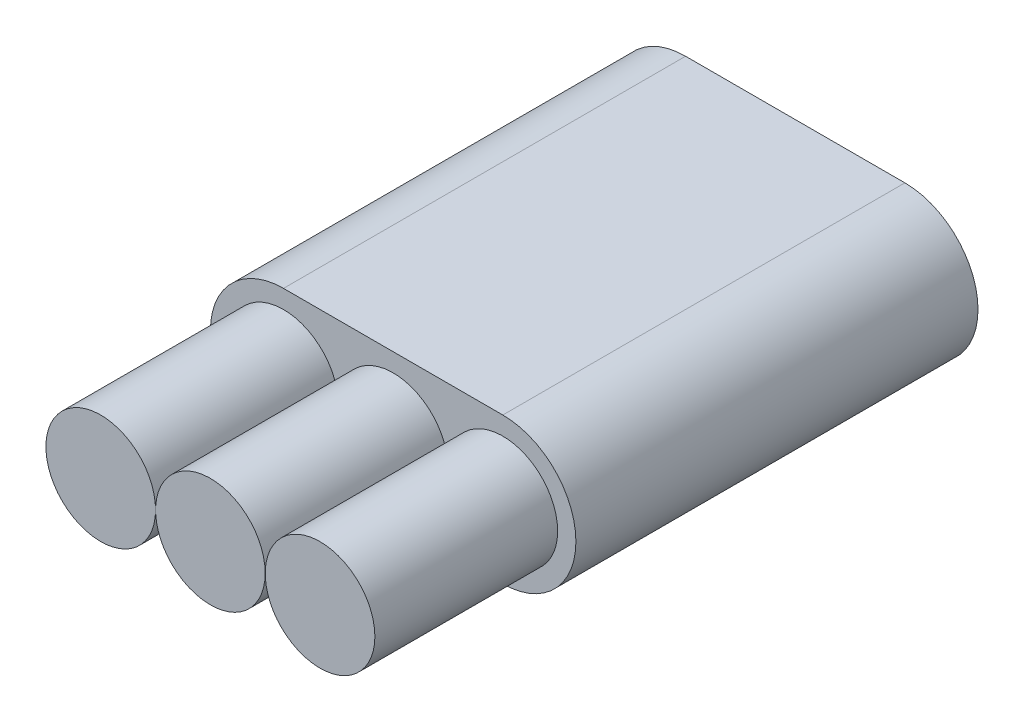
ISO-10303-21;
HEADER;
FILE_DESCRIPTION(('STEP AP214'),'2;1');
FILE_NAME('part.step','',(''),(''),'','','');
FILE_SCHEMA(('AUTOMOTIVE_DESIGN { 1 0 10303 214 1 1 1 1 }'));
ENDSEC;
DATA;
#1=APPLICATION_CONTEXT('core data for automotive mechanical design processes');
#2=APPLICATION_PROTOCOL_DEFINITION('international standard','automotive_design',2000,#1);
#3=PRODUCT_CONTEXT('',#1,'mechanical');
#4=PRODUCT('Part','Part','',(#3));
#5=PRODUCT_RELATED_PRODUCT_CATEGORY('part','',(#4));
#6=PRODUCT_DEFINITION_FORMATION('','',#4);
#7=PRODUCT_DEFINITION_CONTEXT('part definition',#1,'design');
#8=PRODUCT_DEFINITION('design','',#6,#7);
#9=PRODUCT_DEFINITION_SHAPE('','',#8);
#10=(LENGTH_UNIT() NAMED_UNIT(*) SI_UNIT(.MILLI.,.METRE.));
#11=(NAMED_UNIT(*) PLANE_ANGLE_UNIT() SI_UNIT($,.RADIAN.));
#12=(NAMED_UNIT(*) SI_UNIT($,.STERADIAN.) SOLID_ANGLE_UNIT());
#13=UNCERTAINTY_MEASURE_WITH_UNIT(LENGTH_MEASURE(1.E-05),#10,'distance_accuracy_value','');
#14=(GEOMETRIC_REPRESENTATION_CONTEXT(3) GLOBAL_UNCERTAINTY_ASSIGNED_CONTEXT((#13)) GLOBAL_UNIT_ASSIGNED_CONTEXT((#10,
#11,#12)) REPRESENTATION_CONTEXT('',''));
#15=CARTESIAN_POINT('',(0.,0.,0.));
#16=DIRECTION('',(0.,0.,1.));
#17=DIRECTION('',(1.,0.,0.));
#18=AXIS2_PLACEMENT_3D('',#15,#16,#17);
#19=CARTESIAN_POINT('',(1.5,1.5,11.));
#20=DIRECTION('',(0.,0.,1.));
#21=DIRECTION('',(1.,0.,0.));
#22=AXIS2_PLACEMENT_3D('',#19,#20,#21);
#23=PLANE('',#22);
#24=CARTESIAN_POINT('',(7.5,1.5,11.));
#25=DIRECTION('',(0.,0.,1.));
#26=DIRECTION('',(1.,0.,0.));
#27=AXIS2_PLACEMENT_3D('',#24,#25,#26);
#28=CIRCLE('',#27,1.5);
#29=CARTESIAN_POINT('',(9.,1.5,11.));
#30=VERTEX_POINT('',#29);
#31=EDGE_CURVE('E115',#30,#30,#28,.T.);
#32=ORIENTED_EDGE('',*,*,#31,.F.);
#33=EDGE_LOOP('',(#32));
#34=FACE_BOUND('',#33,.T.);
#35=CARTESIAN_POINT('',(1.5,1.5,11.));
#36=DIRECTION('',(0.,0.,1.));
#37=DIRECTION('',(1.,0.,0.));
#38=AXIS2_PLACEMENT_3D('',#35,#36,#37);
#39=CIRCLE('',#38,2.);
#40=CARTESIAN_POINT('',(1.5,3.5,11.));
#41=VERTEX_POINT('',#40);
#42=CARTESIAN_POINT('',(1.5,-0.5,11.));
#43=VERTEX_POINT('',#42);
#44=EDGE_CURVE('E86',#41,#43,#39,.T.);
#45=ORIENTED_EDGE('',*,*,#44,.T.);
#46=DIRECTION('',(1.,0.,0.));
#47=VECTOR('',#46,1.);
#48=CARTESIAN_POINT('',(1.5,-0.5,11.));
#49=LINE('',#48,#47);
#50=CARTESIAN_POINT('',(7.5,-0.5,11.));
#51=VERTEX_POINT('',#50);
#52=EDGE_CURVE('E81',#43,#51,#49,.T.);
#53=ORIENTED_EDGE('',*,*,#52,.T.);
#54=CARTESIAN_POINT('',(7.5,1.5,11.));
#55=DIRECTION('',(0.,0.,1.));
#56=DIRECTION('',(-1.,0.,0.));
#57=AXIS2_PLACEMENT_3D('',#54,#55,#56);
#58=CIRCLE('',#57,2.);
#59=CARTESIAN_POINT('',(7.5,3.5,11.));
#60=VERTEX_POINT('',#59);
#61=EDGE_CURVE('E84',#51,#60,#58,.T.);
#62=ORIENTED_EDGE('',*,*,#61,.T.);
#63=DIRECTION('',(-1.,0.,0.));
#64=VECTOR('',#63,1.);
#65=CARTESIAN_POINT('',(1.5,3.5,11.));
#66=LINE('',#65,#64);
#67=EDGE_CURVE('E51',#60,#41,#66,.T.);
#68=ORIENTED_EDGE('',*,*,#67,.T.);
#69=EDGE_LOOP('',(#45,#53,#62,#68));
#70=FACE_BOUND('',#69,.T.);
#71=CARTESIAN_POINT('',(1.5,1.5,11.));
#72=DIRECTION('',(0.,0.,1.));
#73=DIRECTION('',(1.,0.,0.));
#74=AXIS2_PLACEMENT_3D('',#71,#72,#73);
#75=CIRCLE('',#74,1.5);
#76=CARTESIAN_POINT('',(3.,1.5,11.));
#77=VERTEX_POINT('',#76);
#78=EDGE_CURVE('E112',#77,#77,#75,.T.);
#79=ORIENTED_EDGE('',*,*,#78,.F.);
#80=EDGE_LOOP('',(#79));
#81=FACE_BOUND('',#80,.T.);
#82=CARTESIAN_POINT('',(4.5,1.5,11.));
#83=DIRECTION('',(0.,0.,1.));
#84=DIRECTION('',(1.,0.,0.));
#85=AXIS2_PLACEMENT_3D('',#82,#83,#84);
#86=CIRCLE('',#85,1.499);
#87=CARTESIAN_POINT('',(5.999,1.5,11.));
#88=VERTEX_POINT('',#87);
#89=EDGE_CURVE('E121',#88,#88,#86,.T.);
#90=ORIENTED_EDGE('',*,*,#89,.F.);
#91=EDGE_LOOP('',(#90));
#92=FACE_BOUND('',#91,.T.);
#93=ADVANCED_FACE('F34',(#34,#70,#81,#92),#23,.T.);
#94=CARTESIAN_POINT('',(1.5,1.5,11.));
#95=DIRECTION('',(0.,0.,-1.));
#96=DIRECTION('',(-1.,0.,0.));
#97=AXIS2_PLACEMENT_3D('',#94,#95,#96);
#98=CYLINDRICAL_SURFACE('',#97,2.);
#99=CARTESIAN_POINT('',(1.5,1.5,0.));
#100=DIRECTION('',(0.,0.,1.));
#101=DIRECTION('',(1.,0.,0.));
#102=AXIS2_PLACEMENT_3D('',#99,#100,#101);
#103=CIRCLE('',#102,2.);
#104=CARTESIAN_POINT('',(1.5,3.5,0.));
#105=VERTEX_POINT('',#104);
#106=CARTESIAN_POINT('',(1.5,-0.5,0.));
#107=VERTEX_POINT('',#106);
#108=EDGE_CURVE('E98',#105,#107,#103,.T.);
#109=ORIENTED_EDGE('',*,*,#108,.T.);
#110=DIRECTION('',(0.,0.,-1.));
#111=VECTOR('',#110,1.);
#112=CARTESIAN_POINT('',(1.5,-0.5,11.));
#113=LINE('',#112,#111);
#114=EDGE_CURVE('E11',#43,#107,#113,.T.);
#115=ORIENTED_EDGE('',*,*,#114,.F.);
#116=ORIENTED_EDGE('',*,*,#44,.F.);
#117=DIRECTION('',(0.,0.,-1.));
#118=VECTOR('',#117,1.);
#119=CARTESIAN_POINT('',(1.5,3.5,11.));
#120=LINE('',#119,#118);
#121=EDGE_CURVE('E94',#41,#105,#120,.T.);
#122=ORIENTED_EDGE('',*,*,#121,.T.);
#123=EDGE_LOOP('',(#109,#115,#116,#122));
#124=FACE_BOUND('',#123,.T.);
#125=ADVANCED_FACE('F36',(#124),#98,.T.);
#126=CARTESIAN_POINT('',(1.5,-0.5,11.));
#127=DIRECTION('',(0.,1.,0.));
#128=DIRECTION('',(0.,0.,1.));
#129=AXIS2_PLACEMENT_3D('',#126,#127,#128);
#130=PLANE('',#129);
#131=DIRECTION('',(1.,0.,0.));
#132=VECTOR('',#131,1.);
#133=CARTESIAN_POINT('',(1.5,-0.5,0.));
#134=LINE('',#133,#132);
#135=CARTESIAN_POINT('',(7.5,-0.5,0.));
#136=VERTEX_POINT('',#135);
#137=EDGE_CURVE('E90',#107,#136,#134,.T.);
#138=ORIENTED_EDGE('',*,*,#137,.T.);
#139=DIRECTION('',(0.,0.,-1.));
#140=VECTOR('',#139,1.);
#141=CARTESIAN_POINT('',(7.5,-0.5,11.));
#142=LINE('',#141,#140);
#143=EDGE_CURVE('E43',#51,#136,#142,.T.);
#144=ORIENTED_EDGE('',*,*,#143,.F.);
#145=ORIENTED_EDGE('',*,*,#52,.F.);
#146=ORIENTED_EDGE('',*,*,#114,.T.);
#147=EDGE_LOOP('',(#138,#144,#145,#146));
#148=FACE_BOUND('',#147,.T.);
#149=ADVANCED_FACE('F89',(#148),#130,.F.);
#150=CARTESIAN_POINT('',(7.5,1.5,11.));
#151=DIRECTION('',(0.,0.,-1.));
#152=DIRECTION('',(-1.,0.,0.));
#153=AXIS2_PLACEMENT_3D('',#150,#151,#152);
#154=CYLINDRICAL_SURFACE('',#153,2.);
#155=CARTESIAN_POINT('',(7.5,1.5,0.));
#156=DIRECTION('',(0.,0.,1.));
#157=DIRECTION('',(-1.,0.,0.));
#158=AXIS2_PLACEMENT_3D('',#155,#156,#157);
#159=CIRCLE('',#158,2.);
#160=CARTESIAN_POINT('',(7.5,3.5,0.));
#161=VERTEX_POINT('',#160);
#162=EDGE_CURVE('E68',#136,#161,#159,.T.);
#163=ORIENTED_EDGE('',*,*,#162,.T.);
#164=DIRECTION('',(0.,0.,-1.));
#165=VECTOR('',#164,1.);
#166=CARTESIAN_POINT('',(7.5,3.5,11.));
#167=LINE('',#166,#165);
#168=EDGE_CURVE('E91',#60,#161,#167,.T.);
#169=ORIENTED_EDGE('',*,*,#168,.F.);
#170=ORIENTED_EDGE('',*,*,#61,.F.);
#171=ORIENTED_EDGE('',*,*,#143,.T.);
#172=EDGE_LOOP('',(#163,#169,#170,#171));
#173=FACE_BOUND('',#172,.T.);
#174=ADVANCED_FACE('F92',(#173),#154,.T.);
#175=CARTESIAN_POINT('',(1.5,3.5,11.));
#176=DIRECTION('',(0.,-1.,0.));
#177=DIRECTION('',(1.,0.,0.));
#178=AXIS2_PLACEMENT_3D('',#175,#176,#177);
#179=PLANE('',#178);
#180=DIRECTION('',(-1.,0.,0.));
#181=VECTOR('',#180,1.);
#182=CARTESIAN_POINT('',(1.5,3.5,0.));
#183=LINE('',#182,#181);
#184=EDGE_CURVE('E74',#161,#105,#183,.T.);
#185=ORIENTED_EDGE('',*,*,#184,.T.);
#186=ORIENTED_EDGE('',*,*,#121,.F.);
#187=ORIENTED_EDGE('',*,*,#67,.F.);
#188=ORIENTED_EDGE('',*,*,#168,.T.);
#189=EDGE_LOOP('',(#185,#186,#187,#188));
#190=FACE_BOUND('',#189,.T.);
#191=ADVANCED_FACE('F106',(#190),#179,.F.);
#192=CARTESIAN_POINT('',(1.5,1.5,0.));
#193=DIRECTION('',(0.,0.,1.));
#194=DIRECTION('',(1.,0.,0.));
#195=AXIS2_PLACEMENT_3D('',#192,#193,#194);
#196=PLANE('',#195);
#197=ORIENTED_EDGE('',*,*,#108,.F.);
#198=ORIENTED_EDGE('',*,*,#184,.F.);
#199=ORIENTED_EDGE('',*,*,#162,.F.);
#200=ORIENTED_EDGE('',*,*,#137,.F.);
#201=EDGE_LOOP('',(#197,#198,#199,#200));
#202=FACE_BOUND('',#201,.T.);
#203=ADVANCED_FACE('F109',(#202),#196,.F.);
#204=CARTESIAN_POINT('',(1.5,1.5,16.));
#205=DIRECTION('',(0.,0.,-1.));
#206=DIRECTION('',(-1.,0.,0.));
#207=AXIS2_PLACEMENT_3D('',#204,#205,#206);
#208=CYLINDRICAL_SURFACE('',#207,1.5);
#209=CARTESIAN_POINT('',(1.5,1.5,16.));
#210=DIRECTION('',(0.,0.,1.));
#211=DIRECTION('',(1.,0.,0.));
#212=AXIS2_PLACEMENT_3D('',#209,#210,#211);
#213=CIRCLE('',#212,1.5);
#214=CARTESIAN_POINT('',(3.,1.5,16.));
#215=VERTEX_POINT('',#214);
#216=EDGE_CURVE('E101',#215,#215,#213,.T.);
#217=ORIENTED_EDGE('',*,*,#216,.F.);
#218=EDGE_LOOP('',(#217));
#219=FACE_BOUND('',#218,.T.);
#220=ORIENTED_EDGE('',*,*,#78,.T.);
#221=EDGE_LOOP('',(#220));
#222=FACE_BOUND('',#221,.T.);
#223=ADVANCED_FACE('F141',(#219,#222),#208,.T.);
#224=CARTESIAN_POINT('',(1.5,1.5,16.));
#225=DIRECTION('',(0.,0.,1.));
#226=DIRECTION('',(1.,0.,0.));
#227=AXIS2_PLACEMENT_3D('',#224,#225,#226);
#228=PLANE('',#227);
#229=ORIENTED_EDGE('',*,*,#216,.T.);
#230=EDGE_LOOP('',(#229));
#231=FACE_BOUND('',#230,.T.);
#232=ADVANCED_FACE('F173',(#231),#228,.T.);
#233=CARTESIAN_POINT('',(7.5,1.5,16.));
#234=DIRECTION('',(0.,0.,-1.));
#235=DIRECTION('',(-1.,0.,0.));
#236=AXIS2_PLACEMENT_3D('',#233,#234,#235);
#237=CYLINDRICAL_SURFACE('',#236,1.5);
#238=CARTESIAN_POINT('',(7.5,1.5,16.));
#239=DIRECTION('',(0.,0.,1.));
#240=DIRECTION('',(1.,0.,0.));
#241=AXIS2_PLACEMENT_3D('',#238,#239,#240);
#242=CIRCLE('',#241,1.5);
#243=CARTESIAN_POINT('',(9.,1.5,16.));
#244=VERTEX_POINT('',#243);
#245=EDGE_CURVE('E118',#244,#244,#242,.T.);
#246=ORIENTED_EDGE('',*,*,#245,.F.);
#247=EDGE_LOOP('',(#246));
#248=FACE_BOUND('',#247,.T.);
#249=ORIENTED_EDGE('',*,*,#31,.T.);
#250=EDGE_LOOP('',(#249));
#251=FACE_BOUND('',#250,.T.);
#252=ADVANCED_FACE('F180',(#248,#251),#237,.T.);
#253=CARTESIAN_POINT('',(7.5,1.5,16.));
#254=DIRECTION('',(0.,0.,1.));
#255=DIRECTION('',(1.,0.,0.));
#256=AXIS2_PLACEMENT_3D('',#253,#254,#255);
#257=PLANE('',#256);
#258=ORIENTED_EDGE('',*,*,#245,.T.);
#259=EDGE_LOOP('',(#258));
#260=FACE_BOUND('',#259,.T.);
#261=ADVANCED_FACE('F187',(#260),#257,.T.);
#262=CARTESIAN_POINT('',(4.5,1.5,16.));
#263=DIRECTION('',(0.,0.,-1.));
#264=DIRECTION('',(-1.,0.,0.));
#265=AXIS2_PLACEMENT_3D('',#262,#263,#264);
#266=CYLINDRICAL_SURFACE('',#265,1.499);
#267=CARTESIAN_POINT('',(4.5,1.5,16.));
#268=DIRECTION('',(0.,0.,1.));
#269=DIRECTION('',(1.,0.,0.));
#270=AXIS2_PLACEMENT_3D('',#267,#268,#269);
#271=CIRCLE('',#270,1.499);
#272=CARTESIAN_POINT('',(5.999,1.5,16.));
#273=VERTEX_POINT('',#272);
#274=EDGE_CURVE('E124',#273,#273,#271,.T.);
#275=ORIENTED_EDGE('',*,*,#274,.F.);
#276=EDGE_LOOP('',(#275));
#277=FACE_BOUND('',#276,.T.);
#278=ORIENTED_EDGE('',*,*,#89,.T.);
#279=EDGE_LOOP('',(#278));
#280=FACE_BOUND('',#279,.T.);
#281=ADVANCED_FACE('F130',(#277,#280),#266,.T.);
#282=CARTESIAN_POINT('',(4.5,1.5,16.));
#283=DIRECTION('',(0.,0.,1.));
#284=DIRECTION('',(1.,0.,0.));
#285=AXIS2_PLACEMENT_3D('',#282,#283,#284);
#286=PLANE('',#285);
#287=ORIENTED_EDGE('',*,*,#274,.T.);
#288=EDGE_LOOP('',(#287));
#289=FACE_BOUND('',#288,.T.);
#290=ADVANCED_FACE('F202',(#289),#286,.T.);
#291=CLOSED_SHELL('',(#93,#125,#149,#174,#191,#203,#223,#232,#252,#261,#281,#290));
#292=MANIFOLD_SOLID_BREP('B2',#291);
#293=ADVANCED_BREP_SHAPE_REPRESENTATION('',(#18,#292),#14);
#294=SHAPE_DEFINITION_REPRESENTATION(#9,#293);
ENDSEC;
END-ISO-10303-21;
